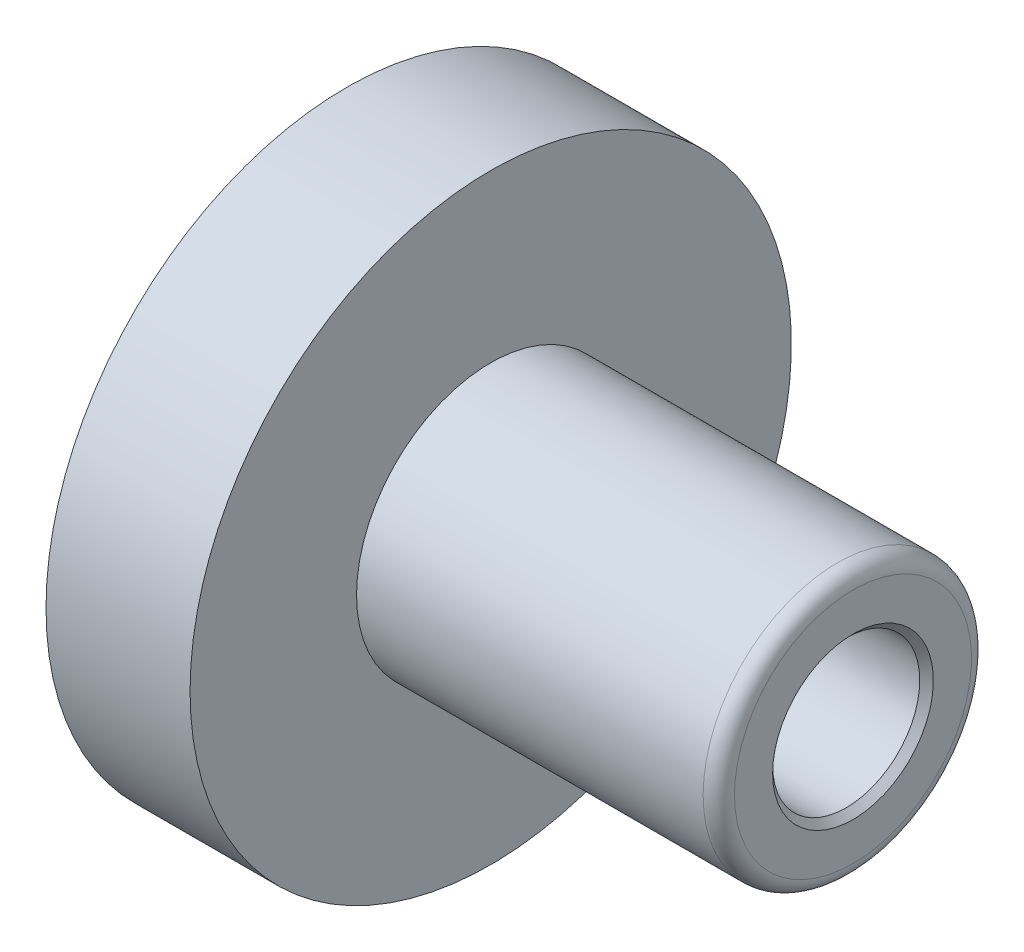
from build123d import *

# Parameters (mm, degrees)
SKETCH2_R          = 3.2004
CUT_EXTRUDE1_DEPTH = 7.9502
SKETCH3_R          = 7.3787
CUT_EXTRUDE2_DEPTH = 67.33394917
CHAMFER1_SIZE      = 0.6858


with BuildPart() as part:
    # Sketch1 → Revolve1 (revolve)
    with BuildSketch(Plane.XY, mode=Mode.PRIVATE) as revolve1_sk:
        with BuildLine():
            Line((0, 9.906), (0, 30.1625))
            Line((0, 30.1625), (14.4526, 30.1625))
            Line((14.4526, 30.1625), (14.4526, 13.462))
            Line((14.4526, 13.462), (49.2252, 13.462))
            ThreePointArc((49.2252, 13.462), (50.338751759, 13.000751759), (50.8, 11.8872))
            Line((50.8, 11.8872), (50.8, 0))
            Line((50.8, 0), (30.9372, 0))
            Line((30.9372, 0), (30.9372, 9.906))
            Line((30.9372, 9.906), (0, 9.906))
        make_face()
    revolve(revolve1_sk.sketch.rotate(Axis((0, 0, 0), (1, 0, 0)), 90), axis=Axis((0, 0, 0), (1, 0, 0)))

    # Sketch2 → Cut-Extrude1 (cut)
    with BuildSketch(Plane.ZY):
        with Locations((-19.939, 0)):
            Circle(SKETCH2_R)
        with Locations(Location((19.939, 0, 0), (0, 0, 180))):
            Circle(SKETCH2_R)
    extrude(amount=-CUT_EXTRUDE1_DEPTH, mode=Mode.SUBTRACT)

    # Sketch3 → Cut-Extrude2 (cut, through all)
    with BuildSketch(Plane(origin=(50.8, 0, 0), x_dir=(0, 0, -1), z_dir=(1, 0, 0))):
        Circle(SKETCH3_R)
    extrude(amount=-CUT_EXTRUDE2_DEPTH, mode=Mode.SUBTRACT)

    # Chamfer1
    chamfer1_edges = [part.edges().sort_by_distance(p)[0] for p in [
        (50.8, 0, 7.3787),
    ]]
    chamfer(chamfer1_edges, length=CHAMFER1_SIZE)


solid = part.part
